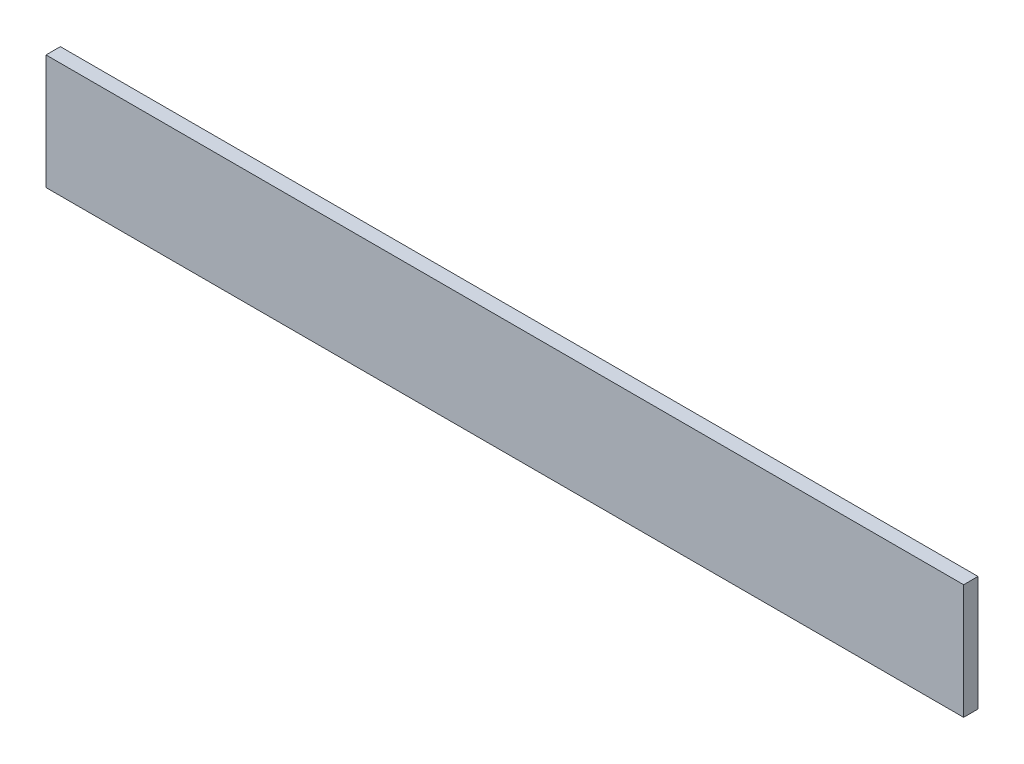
ISO-10303-21;
HEADER;
FILE_DESCRIPTION(('STEP AP214'),'2;1');
FILE_NAME('part.step','',(''),(''),'','','');
FILE_SCHEMA(('AUTOMOTIVE_DESIGN { 1 0 10303 214 1 1 1 1 }'));
ENDSEC;
DATA;
#1=APPLICATION_CONTEXT('core data for automotive mechanical design processes');
#2=APPLICATION_PROTOCOL_DEFINITION('international standard','automotive_design',2000,#1);
#3=PRODUCT_CONTEXT('',#1,'mechanical');
#4=PRODUCT('Part','Part','',(#3));
#5=PRODUCT_RELATED_PRODUCT_CATEGORY('part','',(#4));
#6=PRODUCT_DEFINITION_FORMATION('','',#4);
#7=PRODUCT_DEFINITION_CONTEXT('part definition',#1,'design');
#8=PRODUCT_DEFINITION('design','',#6,#7);
#9=PRODUCT_DEFINITION_SHAPE('','',#8);
#10=(LENGTH_UNIT() NAMED_UNIT(*) SI_UNIT(.MILLI.,.METRE.));
#11=(NAMED_UNIT(*) PLANE_ANGLE_UNIT() SI_UNIT($,.RADIAN.));
#12=(NAMED_UNIT(*) SI_UNIT($,.STERADIAN.) SOLID_ANGLE_UNIT());
#13=UNCERTAINTY_MEASURE_WITH_UNIT(LENGTH_MEASURE(1.E-05),#10,'distance_accuracy_value','');
#14=(GEOMETRIC_REPRESENTATION_CONTEXT(3) GLOBAL_UNCERTAINTY_ASSIGNED_CONTEXT((#13)) GLOBAL_UNIT_ASSIGNED_CONTEXT((#10,
#11,#12)) REPRESENTATION_CONTEXT('',''));
#15=CARTESIAN_POINT('',(0.,0.,0.));
#16=DIRECTION('',(0.,0.,1.));
#17=DIRECTION('',(1.,0.,0.));
#18=AXIS2_PLACEMENT_3D('',#15,#16,#17);
#19=CARTESIAN_POINT('',(0.,0.,0.));
#20=DIRECTION('',(0.,0.,1.));
#21=DIRECTION('',(1.,0.,0.));
#22=AXIS2_PLACEMENT_3D('',#19,#20,#21);
#23=PLANE('',#22);
#24=DIRECTION('',(1.,0.,0.));
#25=VECTOR('',#24,1.);
#26=CARTESIAN_POINT('',(-159.75,-20.,0.));
#27=LINE('',#26,#25);
#28=CARTESIAN_POINT('',(159.75,-20.,0.));
#29=VERTEX_POINT('',#28);
#30=CARTESIAN_POINT('',(-159.75,-20.,0.));
#31=VERTEX_POINT('',#30);
#32=EDGE_CURVE('E81',#29,#31,#27,.F.);
#33=ORIENTED_EDGE('',*,*,#32,.T.);
#34=DIRECTION('',(0.,1.,0.));
#35=VECTOR('',#34,1.);
#36=CARTESIAN_POINT('',(-159.75,20.,0.));
#37=LINE('',#36,#35);
#38=CARTESIAN_POINT('',(-159.75,20.,0.));
#39=VERTEX_POINT('',#38);
#40=EDGE_CURVE('E68',#31,#39,#37,.T.);
#41=ORIENTED_EDGE('',*,*,#40,.T.);
#42=DIRECTION('',(1.,0.,0.));
#43=VECTOR('',#42,1.);
#44=CARTESIAN_POINT('',(-159.75,20.,0.));
#45=LINE('',#44,#43);
#46=CARTESIAN_POINT('',(159.75,20.,0.));
#47=VERTEX_POINT('',#46);
#48=EDGE_CURVE('E55',#39,#47,#45,.T.);
#49=ORIENTED_EDGE('',*,*,#48,.T.);
#50=DIRECTION('',(0.,1.,0.));
#51=VECTOR('',#50,1.);
#52=CARTESIAN_POINT('',(159.75,20.,0.));
#53=LINE('',#52,#51);
#54=EDGE_CURVE('E20',#47,#29,#53,.F.);
#55=ORIENTED_EDGE('',*,*,#54,.T.);
#56=EDGE_LOOP('',(#33,#41,#49,#55));
#57=FACE_BOUND('',#56,.T.);
#58=ADVANCED_FACE('F17',(#57),#23,.F.);
#59=CARTESIAN_POINT('',(159.75,20.,5.));
#60=DIRECTION('',(-1.,0.,0.));
#61=DIRECTION('',(0.,0.,1.));
#62=AXIS2_PLACEMENT_3D('',#59,#60,#61);
#63=PLANE('',#62);
#64=DIRECTION('',(0.,0.,-1.));
#65=VECTOR('',#64,1.);
#66=CARTESIAN_POINT('',(159.75,20.,5.));
#67=LINE('',#66,#65);
#68=CARTESIAN_POINT('',(159.75,20.,5.));
#69=VERTEX_POINT('',#68);
#70=EDGE_CURVE('E61',#47,#69,#67,.F.);
#71=ORIENTED_EDGE('',*,*,#70,.T.);
#72=DIRECTION('',(0.,1.,0.));
#73=VECTOR('',#72,1.);
#74=CARTESIAN_POINT('',(159.75,0.,5.));
#75=LINE('',#74,#73);
#76=CARTESIAN_POINT('',(159.75,-20.,5.));
#77=VERTEX_POINT('',#76);
#78=EDGE_CURVE('E83',#77,#69,#75,.T.);
#79=ORIENTED_EDGE('',*,*,#78,.F.);
#80=DIRECTION('',(0.,0.,1.));
#81=VECTOR('',#80,1.);
#82=CARTESIAN_POINT('',(159.75,-20.,5.));
#83=LINE('',#82,#81);
#84=EDGE_CURVE('E64',#77,#29,#83,.F.);
#85=ORIENTED_EDGE('',*,*,#84,.T.);
#86=ORIENTED_EDGE('',*,*,#54,.F.);
#87=EDGE_LOOP('',(#71,#79,#85,#86));
#88=FACE_BOUND('',#87,.T.);
#89=ADVANCED_FACE('F60',(#88),#63,.F.);
#90=CARTESIAN_POINT('',(-159.75,20.,5.));
#91=DIRECTION('',(0.,-1.,0.));
#92=DIRECTION('',(0.,0.,-1.));
#93=AXIS2_PLACEMENT_3D('',#90,#91,#92);
#94=PLANE('',#93);
#95=DIRECTION('',(0.,0.,-1.));
#96=VECTOR('',#95,1.);
#97=CARTESIAN_POINT('',(-159.75,20.,5.));
#98=LINE('',#97,#96);
#99=CARTESIAN_POINT('',(-159.75,20.,5.));
#100=VERTEX_POINT('',#99);
#101=EDGE_CURVE('E70',#39,#100,#98,.F.);
#102=ORIENTED_EDGE('',*,*,#101,.T.);
#103=DIRECTION('',(1.,0.,0.));
#104=VECTOR('',#103,1.);
#105=CARTESIAN_POINT('',(0.,20.,5.));
#106=LINE('',#105,#104);
#107=EDGE_CURVE('E74',#69,#100,#106,.F.);
#108=ORIENTED_EDGE('',*,*,#107,.F.);
#109=ORIENTED_EDGE('',*,*,#70,.F.);
#110=ORIENTED_EDGE('',*,*,#48,.F.);
#111=EDGE_LOOP('',(#102,#108,#109,#110));
#112=FACE_BOUND('',#111,.T.);
#113=ADVANCED_FACE('F72',(#112),#94,.F.);
#114=CARTESIAN_POINT('',(-159.75,20.,5.));
#115=DIRECTION('',(1.,0.,0.));
#116=DIRECTION('',(0.,0.,-1.));
#117=AXIS2_PLACEMENT_3D('',#114,#115,#116);
#118=PLANE('',#117);
#119=DIRECTION('',(0.,0.,1.));
#120=VECTOR('',#119,1.);
#121=CARTESIAN_POINT('',(-159.75,-20.,5.));
#122=LINE('',#121,#120);
#123=CARTESIAN_POINT('',(-159.75,-20.,5.));
#124=VERTEX_POINT('',#123);
#125=EDGE_CURVE('E35',#31,#124,#122,.T.);
#126=ORIENTED_EDGE('',*,*,#125,.T.);
#127=DIRECTION('',(0.,1.,0.));
#128=VECTOR('',#127,1.);
#129=CARTESIAN_POINT('',(-159.75,0.,5.));
#130=LINE('',#129,#128);
#131=EDGE_CURVE('E26',#100,#124,#130,.F.);
#132=ORIENTED_EDGE('',*,*,#131,.F.);
#133=ORIENTED_EDGE('',*,*,#101,.F.);
#134=ORIENTED_EDGE('',*,*,#40,.F.);
#135=EDGE_LOOP('',(#126,#132,#133,#134));
#136=FACE_BOUND('',#135,.T.);
#137=ADVANCED_FACE('F89',(#136),#118,.F.);
#138=CARTESIAN_POINT('',(-159.75,-20.,5.));
#139=DIRECTION('',(0.,1.,0.));
#140=DIRECTION('',(0.,0.,1.));
#141=AXIS2_PLACEMENT_3D('',#138,#139,#140);
#142=PLANE('',#141);
#143=ORIENTED_EDGE('',*,*,#84,.F.);
#144=DIRECTION('',(1.,0.,0.));
#145=VECTOR('',#144,1.);
#146=CARTESIAN_POINT('',(0.,-20.,5.));
#147=LINE('',#146,#145);
#148=EDGE_CURVE('E11',#124,#77,#147,.T.);
#149=ORIENTED_EDGE('',*,*,#148,.F.);
#150=ORIENTED_EDGE('',*,*,#125,.F.);
#151=ORIENTED_EDGE('',*,*,#32,.F.);
#152=EDGE_LOOP('',(#143,#149,#150,#151));
#153=FACE_BOUND('',#152,.T.);
#154=ADVANCED_FACE('F91',(#153),#142,.F.);
#155=CARTESIAN_POINT('',(0.,0.,5.));
#156=DIRECTION('',(0.,0.,1.));
#157=DIRECTION('',(1.,0.,0.));
#158=AXIS2_PLACEMENT_3D('',#155,#156,#157);
#159=PLANE('',#158);
#160=ORIENTED_EDGE('',*,*,#131,.T.);
#161=ORIENTED_EDGE('',*,*,#148,.T.);
#162=ORIENTED_EDGE('',*,*,#78,.T.);
#163=ORIENTED_EDGE('',*,*,#107,.T.);
#164=EDGE_LOOP('',(#160,#161,#162,#163));
#165=FACE_BOUND('',#164,.T.);
#166=ADVANCED_FACE('F88',(#165),#159,.T.);
#167=CLOSED_SHELL('',(#58,#89,#113,#137,#154,#166));
#168=MANIFOLD_SOLID_BREP('B1',#167);
#169=ADVANCED_BREP_SHAPE_REPRESENTATION('',(#18,#168),#14);
#170=SHAPE_DEFINITION_REPRESENTATION(#9,#169);
ENDSEC;
END-ISO-10303-21;
